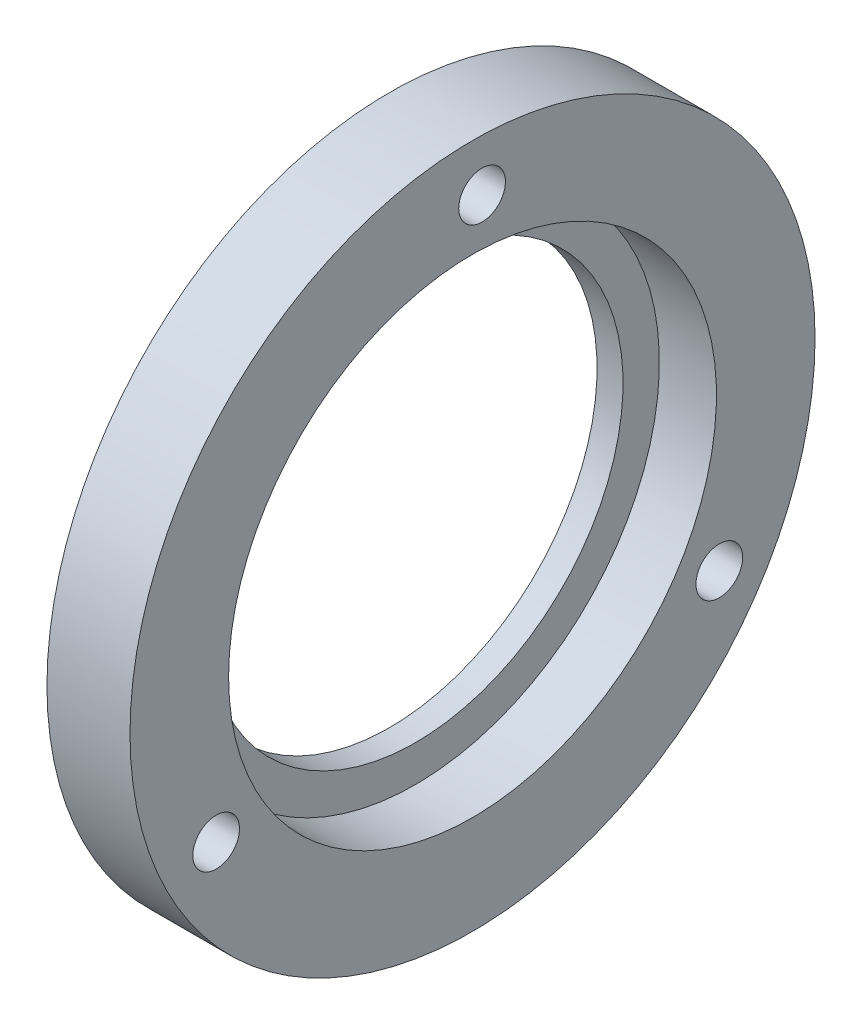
ISO-10303-21;
HEADER;
FILE_DESCRIPTION(('STEP AP214'),'2;1');
FILE_NAME('part.step','',(''),(''),'','','');
FILE_SCHEMA(('AUTOMOTIVE_DESIGN { 1 0 10303 214 1 1 1 1 }'));
ENDSEC;
DATA;
#1=APPLICATION_CONTEXT('core data for automotive mechanical design processes');
#2=APPLICATION_PROTOCOL_DEFINITION('international standard','automotive_design',2000,#1);
#3=PRODUCT_CONTEXT('',#1,'mechanical');
#4=PRODUCT('Part','Part','',(#3));
#5=PRODUCT_RELATED_PRODUCT_CATEGORY('part','',(#4));
#6=PRODUCT_DEFINITION_FORMATION('','',#4);
#7=PRODUCT_DEFINITION_CONTEXT('part definition',#1,'design');
#8=PRODUCT_DEFINITION('design','',#6,#7);
#9=PRODUCT_DEFINITION_SHAPE('','',#8);
#10=(LENGTH_UNIT() NAMED_UNIT(*) SI_UNIT(.MILLI.,.METRE.));
#11=(NAMED_UNIT(*) PLANE_ANGLE_UNIT() SI_UNIT($,.RADIAN.));
#12=(NAMED_UNIT(*) SI_UNIT($,.STERADIAN.) SOLID_ANGLE_UNIT());
#13=UNCERTAINTY_MEASURE_WITH_UNIT(LENGTH_MEASURE(1.E-05),#10,'distance_accuracy_value','');
#14=(GEOMETRIC_REPRESENTATION_CONTEXT(3) GLOBAL_UNCERTAINTY_ASSIGNED_CONTEXT((#13)) GLOBAL_UNIT_ASSIGNED_CONTEXT((#10,
#11,#12)) REPRESENTATION_CONTEXT('',''));
#15=CARTESIAN_POINT('',(0.,0.,0.));
#16=DIRECTION('',(0.,0.,1.));
#17=DIRECTION('',(1.,0.,0.));
#18=AXIS2_PLACEMENT_3D('',#15,#16,#17);
#19=CARTESIAN_POINT('',(-15.1382303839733,0.,0.));
#20=DIRECTION('',(-1.,0.,0.));
#21=DIRECTION('',(0.,0.,1.));
#22=AXIS2_PLACEMENT_3D('',#19,#20,#21);
#23=CYLINDRICAL_SURFACE('',#22,20.);
#24=CARTESIAN_POINT('',(2.5,0.,0.));
#25=DIRECTION('',(-1.,0.,0.));
#26=DIRECTION('',(0.,0.,1.));
#27=AXIS2_PLACEMENT_3D('',#24,#25,#26);
#28=CIRCLE('',#27,20.);
#29=CARTESIAN_POINT('',(2.5,0.,20.));
#30=VERTEX_POINT('',#29);
#31=EDGE_CURVE('E53',#30,#30,#28,.T.);
#32=ORIENTED_EDGE('',*,*,#31,.F.);
#33=EDGE_LOOP('',(#32));
#34=FACE_BOUND('',#33,.T.);
#35=CARTESIAN_POINT('',(0.,0.,0.));
#36=DIRECTION('',(-1.,0.,0.));
#37=DIRECTION('',(0.,0.,1.));
#38=AXIS2_PLACEMENT_3D('',#35,#36,#37);
#39=CIRCLE('',#38,20.);
#40=CARTESIAN_POINT('',(0.,0.,20.));
#41=VERTEX_POINT('',#40);
#42=EDGE_CURVE('E10',#41,#41,#39,.T.);
#43=ORIENTED_EDGE('',*,*,#42,.T.);
#44=EDGE_LOOP('',(#43));
#45=FACE_BOUND('',#44,.T.);
#46=ADVANCED_FACE('F31',(#34,#45),#23,.F.);
#47=CARTESIAN_POINT('',(0.,20.,0.));
#48=DIRECTION('',(1.,0.,0.));
#49=DIRECTION('',(0.,0.,-1.));
#50=AXIS2_PLACEMENT_3D('',#47,#48,#49);
#51=PLANE('',#50);
#52=CARTESIAN_POINT('',(0.,-14.7907987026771,-23.7746140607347));
#53=DIRECTION('',(-1.,0.,0.));
#54=DIRECTION('',(0.,0.,1.));
#55=AXIS2_PLACEMENT_3D('',#52,#53,#54);
#56=CIRCLE('',#55,4.);
#57=CARTESIAN_POINT('',(0.,-14.7907987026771,-19.7746140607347));
#58=VERTEX_POINT('',#57);
#59=EDGE_CURVE('E89',#58,#58,#56,.T.);
#60=ORIENTED_EDGE('',*,*,#59,.F.);
#61=EDGE_LOOP('',(#60));
#62=FACE_BOUND('',#61,.T.);
#63=CARTESIAN_POINT('',(0.,-13.1940203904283,24.6965144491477));
#64=DIRECTION('',(-1.,0.,0.));
#65=DIRECTION('',(0.,0.,1.));
#66=AXIS2_PLACEMENT_3D('',#63,#64,#65);
#67=CIRCLE('',#66,4.);
#68=CARTESIAN_POINT('',(0.,-13.1940203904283,28.6965144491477));
#69=VERTEX_POINT('',#68);
#70=EDGE_CURVE('E77',#69,#69,#67,.T.);
#71=ORIENTED_EDGE('',*,*,#70,.F.);
#72=EDGE_LOOP('',(#71));
#73=FACE_BOUND('',#72,.T.);
#74=CARTESIAN_POINT('',(0.,27.9848190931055,-0.921900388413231));
#75=DIRECTION('',(-1.,0.,0.));
#76=DIRECTION('',(0.,0.,1.));
#77=AXIS2_PLACEMENT_3D('',#74,#75,#76);
#78=CIRCLE('',#77,4.);
#79=CARTESIAN_POINT('',(0.,27.9848190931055,3.07809961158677));
#80=VERTEX_POINT('',#79);
#81=EDGE_CURVE('E65',#80,#80,#78,.T.);
#82=ORIENTED_EDGE('',*,*,#81,.F.);
#83=EDGE_LOOP('',(#82));
#84=FACE_BOUND('',#83,.T.);
#85=ORIENTED_EDGE('',*,*,#42,.F.);
#86=EDGE_LOOP('',(#85));
#87=FACE_BOUND('',#86,.T.);
#88=CARTESIAN_POINT('',(0.,0.,0.));
#89=DIRECTION('',(-1.,0.,0.));
#90=DIRECTION('',(0.,0.,1.));
#91=AXIS2_PLACEMENT_3D('',#88,#89,#90);
#92=CIRCLE('',#91,33.);
#93=CARTESIAN_POINT('',(0.,0.,33.));
#94=VERTEX_POINT('',#93);
#95=EDGE_CURVE('E37',#94,#94,#92,.T.);
#96=ORIENTED_EDGE('',*,*,#95,.T.);
#97=EDGE_LOOP('',(#96));
#98=FACE_BOUND('',#97,.T.);
#99=ADVANCED_FACE('F95',(#62,#73,#84,#87,#98),#51,.F.);
#100=CARTESIAN_POINT('',(-15.1382303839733,0.,0.));
#101=DIRECTION('',(-1.,0.,0.));
#102=DIRECTION('',(0.,0.,1.));
#103=AXIS2_PLACEMENT_3D('',#100,#101,#102);
#104=CYLINDRICAL_SURFACE('',#103,33.);
#105=ORIENTED_EDGE('',*,*,#95,.F.);
#106=EDGE_LOOP('',(#105));
#107=FACE_BOUND('',#106,.T.);
#108=CARTESIAN_POINT('',(8.,0.,0.));
#109=DIRECTION('',(-1.,0.,0.));
#110=DIRECTION('',(0.,0.,1.));
#111=AXIS2_PLACEMENT_3D('',#108,#109,#110);
#112=CIRCLE('',#111,33.);
#113=CARTESIAN_POINT('',(8.,0.,33.));
#114=VERTEX_POINT('',#113);
#115=EDGE_CURVE('E41',#114,#114,#112,.T.);
#116=ORIENTED_EDGE('',*,*,#115,.T.);
#117=EDGE_LOOP('',(#116));
#118=FACE_BOUND('',#117,.T.);
#119=ADVANCED_FACE('F98',(#107,#118),#104,.T.);
#120=CARTESIAN_POINT('',(8.,33.,0.));
#121=DIRECTION('',(-1.,0.,0.));
#122=DIRECTION('',(0.,0.,1.));
#123=AXIS2_PLACEMENT_3D('',#120,#121,#122);
#124=PLANE('',#123);
#125=CARTESIAN_POINT('',(8.,-14.7907987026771,-23.7746140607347));
#126=DIRECTION('',(-1.,0.,0.));
#127=DIRECTION('',(0.,0.,1.));
#128=AXIS2_PLACEMENT_3D('',#125,#126,#127);
#129=CIRCLE('',#128,2.25);
#130=CARTESIAN_POINT('',(8.,-14.7907987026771,-21.5246140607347));
#131=VERTEX_POINT('',#130);
#132=EDGE_CURVE('E80',#131,#131,#129,.T.);
#133=ORIENTED_EDGE('',*,*,#132,.T.);
#134=EDGE_LOOP('',(#133));
#135=FACE_BOUND('',#134,.T.);
#136=CARTESIAN_POINT('',(8.,-13.1940203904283,24.6965144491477));
#137=DIRECTION('',(-1.,0.,0.));
#138=DIRECTION('',(0.,0.,1.));
#139=AXIS2_PLACEMENT_3D('',#136,#137,#138);
#140=CIRCLE('',#139,2.25);
#141=CARTESIAN_POINT('',(8.,-13.1940203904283,26.9465144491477));
#142=VERTEX_POINT('',#141);
#143=EDGE_CURVE('E68',#142,#142,#140,.T.);
#144=ORIENTED_EDGE('',*,*,#143,.T.);
#145=EDGE_LOOP('',(#144));
#146=FACE_BOUND('',#145,.T.);
#147=CARTESIAN_POINT('',(8.,27.9848190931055,-0.921900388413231));
#148=DIRECTION('',(-1.,0.,0.));
#149=DIRECTION('',(0.,0.,1.));
#150=AXIS2_PLACEMENT_3D('',#147,#148,#149);
#151=CIRCLE('',#150,2.25);
#152=CARTESIAN_POINT('',(8.,27.9848190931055,1.32809961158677));
#153=VERTEX_POINT('',#152);
#154=EDGE_CURVE('E56',#153,#153,#151,.T.);
#155=ORIENTED_EDGE('',*,*,#154,.T.);
#156=EDGE_LOOP('',(#155));
#157=FACE_BOUND('',#156,.T.);
#158=ORIENTED_EDGE('',*,*,#115,.F.);
#159=EDGE_LOOP('',(#158));
#160=FACE_BOUND('',#159,.T.);
#161=CARTESIAN_POINT('',(8.,0.,0.));
#162=DIRECTION('',(-1.,0.,0.));
#163=DIRECTION('',(0.,0.,1.));
#164=AXIS2_PLACEMENT_3D('',#161,#162,#163);
#165=CIRCLE('',#164,23.5);
#166=CARTESIAN_POINT('',(8.,0.,23.5));
#167=VERTEX_POINT('',#166);
#168=EDGE_CURVE('E45',#167,#167,#165,.T.);
#169=ORIENTED_EDGE('',*,*,#168,.T.);
#170=EDGE_LOOP('',(#169));
#171=FACE_BOUND('',#170,.T.);
#172=ADVANCED_FACE('F138',(#135,#146,#157,#160,#171),#124,.F.);
#173=CARTESIAN_POINT('',(-15.1382303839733,0.,0.));
#174=DIRECTION('',(-1.,0.,0.));
#175=DIRECTION('',(0.,0.,1.));
#176=AXIS2_PLACEMENT_3D('',#173,#174,#175);
#177=CYLINDRICAL_SURFACE('',#176,23.5);
#178=ORIENTED_EDGE('',*,*,#168,.F.);
#179=EDGE_LOOP('',(#178));
#180=FACE_BOUND('',#179,.T.);
#181=CARTESIAN_POINT('',(2.5,0.,0.));
#182=DIRECTION('',(-1.,0.,0.));
#183=DIRECTION('',(0.,0.,1.));
#184=AXIS2_PLACEMENT_3D('',#181,#182,#183);
#185=CIRCLE('',#184,23.5);
#186=CARTESIAN_POINT('',(2.5,0.,23.5));
#187=VERTEX_POINT('',#186);
#188=EDGE_CURVE('E50',#187,#187,#185,.T.);
#189=ORIENTED_EDGE('',*,*,#188,.T.);
#190=EDGE_LOOP('',(#189));
#191=FACE_BOUND('',#190,.T.);
#192=ADVANCED_FACE('F129',(#180,#191),#177,.F.);
#193=CARTESIAN_POINT('',(2.5,23.5,0.));
#194=DIRECTION('',(-1.,0.,0.));
#195=DIRECTION('',(0.,0.,1.));
#196=AXIS2_PLACEMENT_3D('',#193,#194,#195);
#197=PLANE('',#196);
#198=ORIENTED_EDGE('',*,*,#188,.F.);
#199=EDGE_LOOP('',(#198));
#200=FACE_BOUND('',#199,.T.);
#201=ORIENTED_EDGE('',*,*,#31,.T.);
#202=EDGE_LOOP('',(#201));
#203=FACE_BOUND('',#202,.T.);
#204=ADVANCED_FACE('F127',(#200,#203),#197,.F.);
#205=CARTESIAN_POINT('',(0.,27.9848190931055,-0.921900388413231));
#206=DIRECTION('',(-1.,0.,0.));
#207=DIRECTION('',(0.,0.,1.));
#208=AXIS2_PLACEMENT_3D('',#205,#206,#207);
#209=CYLINDRICAL_SURFACE('',#208,2.25);
#210=ORIENTED_EDGE('',*,*,#154,.F.);
#211=EDGE_LOOP('',(#210));
#212=FACE_BOUND('',#211,.T.);
#213=CARTESIAN_POINT('',(4.,27.9848190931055,-0.921900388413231));
#214=DIRECTION('',(-1.,0.,0.));
#215=DIRECTION('',(0.,0.,1.));
#216=AXIS2_PLACEMENT_3D('',#213,#214,#215);
#217=CIRCLE('',#216,2.25);
#218=CARTESIAN_POINT('',(4.,27.9848190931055,1.32809961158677));
#219=VERTEX_POINT('',#218);
#220=EDGE_CURVE('E59',#219,#219,#217,.T.);
#221=ORIENTED_EDGE('',*,*,#220,.T.);
#222=EDGE_LOOP('',(#221));
#223=FACE_BOUND('',#222,.T.);
#224=ADVANCED_FACE('F117',(#212,#223),#209,.F.);
#225=CARTESIAN_POINT('',(4.,30.2348190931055,-0.921900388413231));
#226=DIRECTION('',(1.,0.,0.));
#227=DIRECTION('',(0.,0.,-1.));
#228=AXIS2_PLACEMENT_3D('',#225,#226,#227);
#229=PLANE('',#228);
#230=ORIENTED_EDGE('',*,*,#220,.F.);
#231=EDGE_LOOP('',(#230));
#232=FACE_BOUND('',#231,.T.);
#233=CARTESIAN_POINT('',(4.,27.9848190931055,-0.921900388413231));
#234=DIRECTION('',(-1.,0.,0.));
#235=DIRECTION('',(0.,0.,1.));
#236=AXIS2_PLACEMENT_3D('',#233,#234,#235);
#237=CIRCLE('',#236,4.);
#238=CARTESIAN_POINT('',(4.,27.9848190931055,3.07809961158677));
#239=VERTEX_POINT('',#238);
#240=EDGE_CURVE('E62',#239,#239,#237,.T.);
#241=ORIENTED_EDGE('',*,*,#240,.T.);
#242=EDGE_LOOP('',(#241));
#243=FACE_BOUND('',#242,.T.);
#244=ADVANCED_FACE('F107',(#232,#243),#229,.F.);
#245=CARTESIAN_POINT('',(0.,27.9848190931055,-0.921900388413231));
#246=DIRECTION('',(-1.,0.,0.));
#247=DIRECTION('',(0.,0.,1.));
#248=AXIS2_PLACEMENT_3D('',#245,#246,#247);
#249=CYLINDRICAL_SURFACE('',#248,4.);
#250=ORIENTED_EDGE('',*,*,#240,.F.);
#251=EDGE_LOOP('',(#250));
#252=FACE_BOUND('',#251,.T.);
#253=ORIENTED_EDGE('',*,*,#81,.T.);
#254=EDGE_LOOP('',(#253));
#255=FACE_BOUND('',#254,.T.);
#256=ADVANCED_FACE('F104',(#252,#255),#249,.F.);
#257=CARTESIAN_POINT('',(0.,-13.1940203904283,24.6965144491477));
#258=DIRECTION('',(-1.,0.,0.));
#259=DIRECTION('',(0.,0.,1.));
#260=AXIS2_PLACEMENT_3D('',#257,#258,#259);
#261=CYLINDRICAL_SURFACE('',#260,2.25);
#262=ORIENTED_EDGE('',*,*,#143,.F.);
#263=EDGE_LOOP('',(#262));
#264=FACE_BOUND('',#263,.T.);
#265=CARTESIAN_POINT('',(4.,-13.1940203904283,24.6965144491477));
#266=DIRECTION('',(-1.,0.,0.));
#267=DIRECTION('',(0.,0.,1.));
#268=AXIS2_PLACEMENT_3D('',#265,#266,#267);
#269=CIRCLE('',#268,2.25);
#270=CARTESIAN_POINT('',(4.,-13.1940203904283,26.9465144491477));
#271=VERTEX_POINT('',#270);
#272=EDGE_CURVE('E71',#271,#271,#269,.T.);
#273=ORIENTED_EDGE('',*,*,#272,.T.);
#274=EDGE_LOOP('',(#273));
#275=FACE_BOUND('',#274,.T.);
#276=ADVANCED_FACE('F106',(#264,#275),#261,.F.);
#277=CARTESIAN_POINT('',(4.,-10.9440203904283,24.6965144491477));
#278=DIRECTION('',(1.,0.,0.));
#279=DIRECTION('',(0.,0.,-1.));
#280=AXIS2_PLACEMENT_3D('',#277,#278,#279);
#281=PLANE('',#280);
#282=ORIENTED_EDGE('',*,*,#272,.F.);
#283=EDGE_LOOP('',(#282));
#284=FACE_BOUND('',#283,.T.);
#285=CARTESIAN_POINT('',(4.,-13.1940203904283,24.6965144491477));
#286=DIRECTION('',(-1.,0.,0.));
#287=DIRECTION('',(0.,0.,1.));
#288=AXIS2_PLACEMENT_3D('',#285,#286,#287);
#289=CIRCLE('',#288,4.);
#290=CARTESIAN_POINT('',(4.,-13.1940203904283,28.6965144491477));
#291=VERTEX_POINT('',#290);
#292=EDGE_CURVE('E74',#291,#291,#289,.T.);
#293=ORIENTED_EDGE('',*,*,#292,.T.);
#294=EDGE_LOOP('',(#293));
#295=FACE_BOUND('',#294,.T.);
#296=ADVANCED_FACE('F114',(#284,#295),#281,.F.);
#297=CARTESIAN_POINT('',(0.,-13.1940203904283,24.6965144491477));
#298=DIRECTION('',(-1.,0.,0.));
#299=DIRECTION('',(0.,0.,1.));
#300=AXIS2_PLACEMENT_3D('',#297,#298,#299);
#301=CYLINDRICAL_SURFACE('',#300,4.);
#302=ORIENTED_EDGE('',*,*,#292,.F.);
#303=EDGE_LOOP('',(#302));
#304=FACE_BOUND('',#303,.T.);
#305=ORIENTED_EDGE('',*,*,#70,.T.);
#306=EDGE_LOOP('',(#305));
#307=FACE_BOUND('',#306,.T.);
#308=ADVANCED_FACE('F189',(#304,#307),#301,.F.);
#309=CARTESIAN_POINT('',(0.,-14.7907987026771,-23.7746140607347));
#310=DIRECTION('',(-1.,0.,0.));
#311=DIRECTION('',(0.,0.,1.));
#312=AXIS2_PLACEMENT_3D('',#309,#310,#311);
#313=CYLINDRICAL_SURFACE('',#312,2.25);
#314=ORIENTED_EDGE('',*,*,#132,.F.);
#315=EDGE_LOOP('',(#314));
#316=FACE_BOUND('',#315,.T.);
#317=CARTESIAN_POINT('',(4.,-14.7907987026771,-23.7746140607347));
#318=DIRECTION('',(-1.,0.,0.));
#319=DIRECTION('',(0.,0.,1.));
#320=AXIS2_PLACEMENT_3D('',#317,#318,#319);
#321=CIRCLE('',#320,2.25);
#322=CARTESIAN_POINT('',(4.,-14.7907987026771,-21.5246140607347));
#323=VERTEX_POINT('',#322);
#324=EDGE_CURVE('E83',#323,#323,#321,.T.);
#325=ORIENTED_EDGE('',*,*,#324,.T.);
#326=EDGE_LOOP('',(#325));
#327=FACE_BOUND('',#326,.T.);
#328=ADVANCED_FACE('F197',(#316,#327),#313,.F.);
#329=CARTESIAN_POINT('',(4.,-12.5407987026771,-23.7746140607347));
#330=DIRECTION('',(1.,0.,0.));
#331=DIRECTION('',(0.,0.,-1.));
#332=AXIS2_PLACEMENT_3D('',#329,#330,#331);
#333=PLANE('',#332);
#334=ORIENTED_EDGE('',*,*,#324,.F.);
#335=EDGE_LOOP('',(#334));
#336=FACE_BOUND('',#335,.T.);
#337=CARTESIAN_POINT('',(4.,-14.7907987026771,-23.7746140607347));
#338=DIRECTION('',(-1.,0.,0.));
#339=DIRECTION('',(0.,0.,1.));
#340=AXIS2_PLACEMENT_3D('',#337,#338,#339);
#341=CIRCLE('',#340,4.);
#342=CARTESIAN_POINT('',(4.,-14.7907987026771,-19.7746140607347));
#343=VERTEX_POINT('',#342);
#344=EDGE_CURVE('E86',#343,#343,#341,.T.);
#345=ORIENTED_EDGE('',*,*,#344,.T.);
#346=EDGE_LOOP('',(#345));
#347=FACE_BOUND('',#346,.T.);
#348=ADVANCED_FACE('F205',(#336,#347),#333,.F.);
#349=CARTESIAN_POINT('',(0.,-14.7907987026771,-23.7746140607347));
#350=DIRECTION('',(-1.,0.,0.));
#351=DIRECTION('',(0.,0.,1.));
#352=AXIS2_PLACEMENT_3D('',#349,#350,#351);
#353=CYLINDRICAL_SURFACE('',#352,4.);
#354=ORIENTED_EDGE('',*,*,#344,.F.);
#355=EDGE_LOOP('',(#354));
#356=FACE_BOUND('',#355,.T.);
#357=ORIENTED_EDGE('',*,*,#59,.T.);
#358=EDGE_LOOP('',(#357));
#359=FACE_BOUND('',#358,.T.);
#360=ADVANCED_FACE('F93',(#356,#359),#353,.F.);
#361=CLOSED_SHELL('',(#46,#99,#119,#172,#192,#204,#224,#244,#256,#276,#296,#308,#328,#348,#360));
#362=MANIFOLD_SOLID_BREP('B2',#361);
#363=ADVANCED_BREP_SHAPE_REPRESENTATION('',(#18,#362),#14);
#364=SHAPE_DEFINITION_REPRESENTATION(#9,#363);
ENDSEC;
END-ISO-10303-21;
